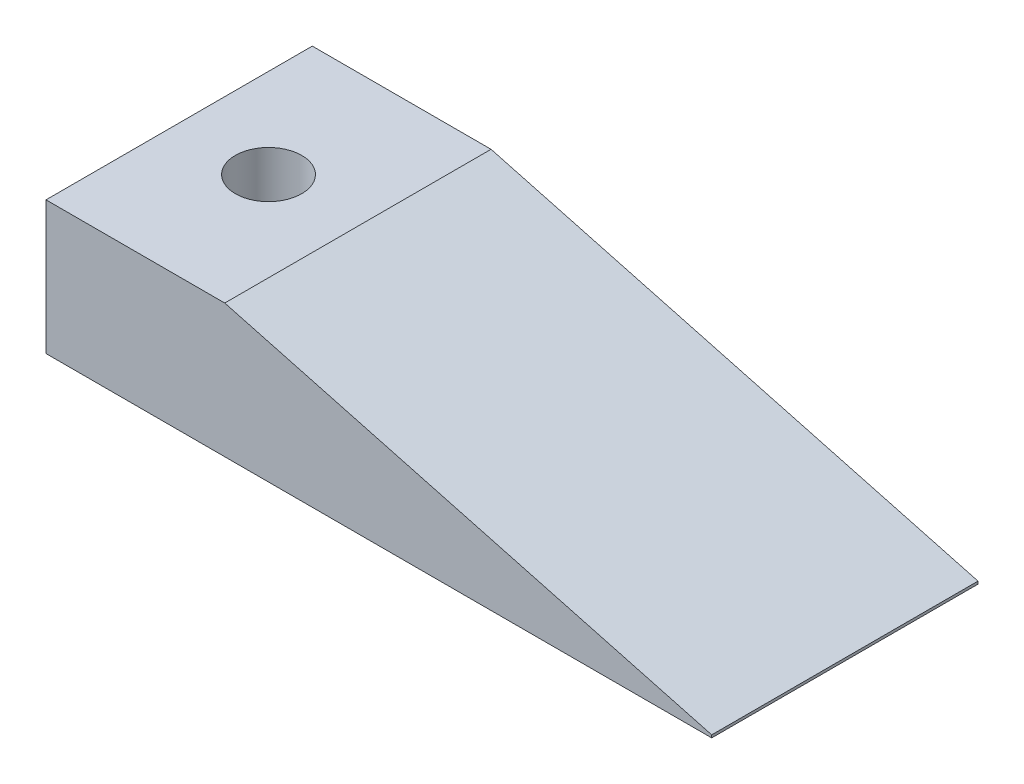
from build123d import *

# Parameters (mm, degrees)
SKIZZE1_W                            = 50
SKIZZE1_H                            = 20
LINEAR_AUSTRAGEN1_DEPTH              = 10
SCHNITT_LINEAR_AUSTRAGEN1_DEPTH      = 55.772255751
SCHNITT_LINEAR_AUSTRAGEN1_DEPTH_BACK = 55.772255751
SKIZZE3_R                            = 2.493880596
SCHNITT_LINEAR_AUSTRAGEN2_DEPTH      = 52.961524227


with BuildPart() as part:
    # Skizze1 → Linear austragen1 (new body)
    with BuildSketch(Plane(origin=(0, 0, 0), x_dir=(1, 0, 0), z_dir=(0, 1, 0))):
        with Locations((25, 0)):
            Rectangle(SKIZZE1_W, SKIZZE1_H)
    extrude(amount=LINEAR_AUSTRAGEN1_DEPTH)

    # Skizze2 → Schnitt-Linear austragen1 (cut, two sides: drawn at the far end of the back side and taken through both)
    with BuildSketch(Plane.XY.offset(10).offset(-SCHNITT_LINEAR_AUSTRAGEN1_DEPTH_BACK)):
        Polygon((-94.663804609, 38.962549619), (13.425902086, 10), (50, 0.2), (158.089706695, -28.762549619), (216.014805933, 187.41686377), (-36.738705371, 255.141963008), align=None)
    extrude(amount=SCHNITT_LINEAR_AUSTRAGEN1_DEPTH + SCHNITT_LINEAR_AUSTRAGEN1_DEPTH_BACK, mode=Mode.SUBTRACT)

    # Skizze3 → Schnitt-Linear austragen2 (cut, through all)
    with BuildSketch(Plane(origin=(0, 10, 0), x_dir=(1, 0, 0), z_dir=(0, 1, 0))):
        with Locations(Location((6.712951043, 0, 0), (0, 0, 270))):
            Circle(SKIZZE3_R)
    extrude(amount=-SCHNITT_LINEAR_AUSTRAGEN2_DEPTH, mode=Mode.SUBTRACT)


solid = part.part
